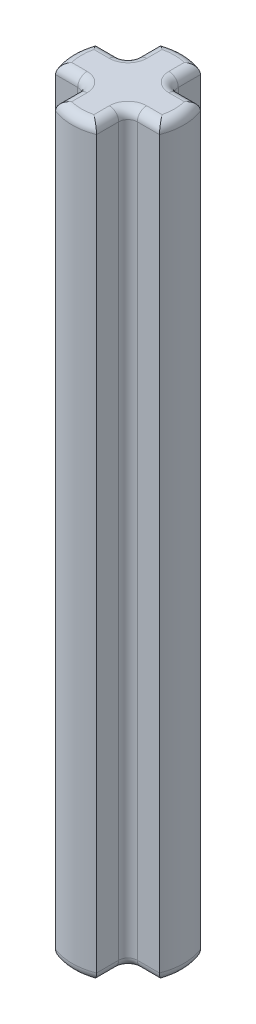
from build123d import *

# Parameters (mm, degrees)
BOSS_EXTRUDE1_DEPTH = 32
FILLET7_R           = 0.4


with BuildPart() as part:
    # Sketch1 → Boss-Extrude1 (new body)
    with BuildSketch(Plane(origin=(0, 0, 0), x_dir=(1, 0, 0), z_dir=(0, 1, 0))):
        with BuildLine():
            Line((-2.232845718, 0.88), (-0.88, 0.88))
            Line((-0.88, 0.88), (-0.88, 2.232845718))
            ThreePointArc((-0.88, 2.232845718), (0, 2.4), (0.88, 2.232845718))
            Line((0.88, 2.232845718), (0.88, 0.88))
            Line((0.88, 0.88), (2.232845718, 0.88))
            ThreePointArc((2.232845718, 0.88), (2.4, 0), (2.232845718, -0.88))
            Line((2.232845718, -0.88), (0.88, -0.88))
            Line((0.88, -0.88), (0.88, -2.232845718))
            ThreePointArc((0.88, -2.232845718), (0, -2.4), (-0.88, -2.232845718))
            Line((-0.88, -2.232845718), (-0.88, -0.88))
            Line((-0.88, -0.88), (-2.232845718, -0.88))
            ThreePointArc((-2.232845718, -0.88), (-2.4, 0), (-2.232845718, 0.88))
        make_face()
    extrude(amount=BOSS_EXTRUDE1_DEPTH)

    # Fillet7
    fillet7_edges = [part.edges().sort_by_distance(p)[0] for p in [
        (-2.4, 32, 0),
        (0, 0, -2.4),
        (0.88, 0, -1.556422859),
        (1.556422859, 0, -0.88),
        (2.4, 0, 0),
        (1.556422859, 0, 0.88),
        (0.88, 0, 1.556422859),
        (-1.556422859, 32, 0.88),
        (0, 0, 2.4),
        (-0.88, 0, 1.556422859),
        (-1.556422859, 0, 0.88),
        (-2.4, 0, 0),
        (-1.556422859, 0, -0.88),
        (-0.88, 0, -1.556422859),
        (-0.88, 32, 1.556422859),
        (0, 32, 2.4),
        (0.88, 16, -0.88),
        (0.88, 16, 0.88),
        (-0.88, 16, 0.88),
        (-0.88, 16, -0.88),
        (0.88, 32, 1.556422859),
        (1.556422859, 32, 0.88),
        (2.4, 32, 0),
        (1.556422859, 32, -0.88),
        (0.88, 32, -1.556422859),
        (0, 32, -2.4),
        (-0.88, 32, -1.556422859),
        (-1.556422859, 32, -0.88),
    ]]
    fillet(fillet7_edges, radius=FILLET7_R)


solid = part.part
